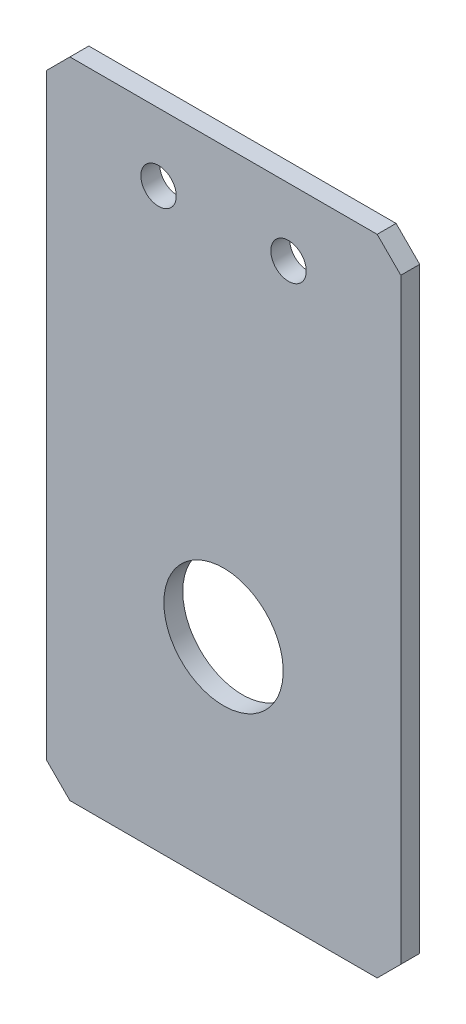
from build123d import *

# Parameters (mm, degrees)
ESQUISSE1_R      = 5.05
ESQUISSE1_R_2    = 1.5
EXTRUSION1_DEPTH = 1.6


with BuildPart() as part:
    # Esquisse1 → Extrusion1 (new body)
    with BuildSketch(Plane.XY):
        Polygon((-13, 71.626711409), (13, 71.626711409), (15, 69.626711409), (15, 19.126711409), (13, 17.126711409), (-13, 17.126711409), (-15, 19.126711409), (-15, 69.626711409), align=None)
        with Locations(Location((0, 35.626711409, 0), (0, 0, 180))):
            Circle(ESQUISSE1_R, mode=Mode.SUBTRACT)
        with Locations(Location((5.5, 65.926711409, 0), (0, 0, 180))):
            Circle(ESQUISSE1_R_2, mode=Mode.SUBTRACT)
        with Locations(Location((-5.5, 65.926711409, 0), (0, 0, 180))):
            Circle(ESQUISSE1_R_2, mode=Mode.SUBTRACT)
    extrude(amount=EXTRUSION1_DEPTH)


solid = part.part
